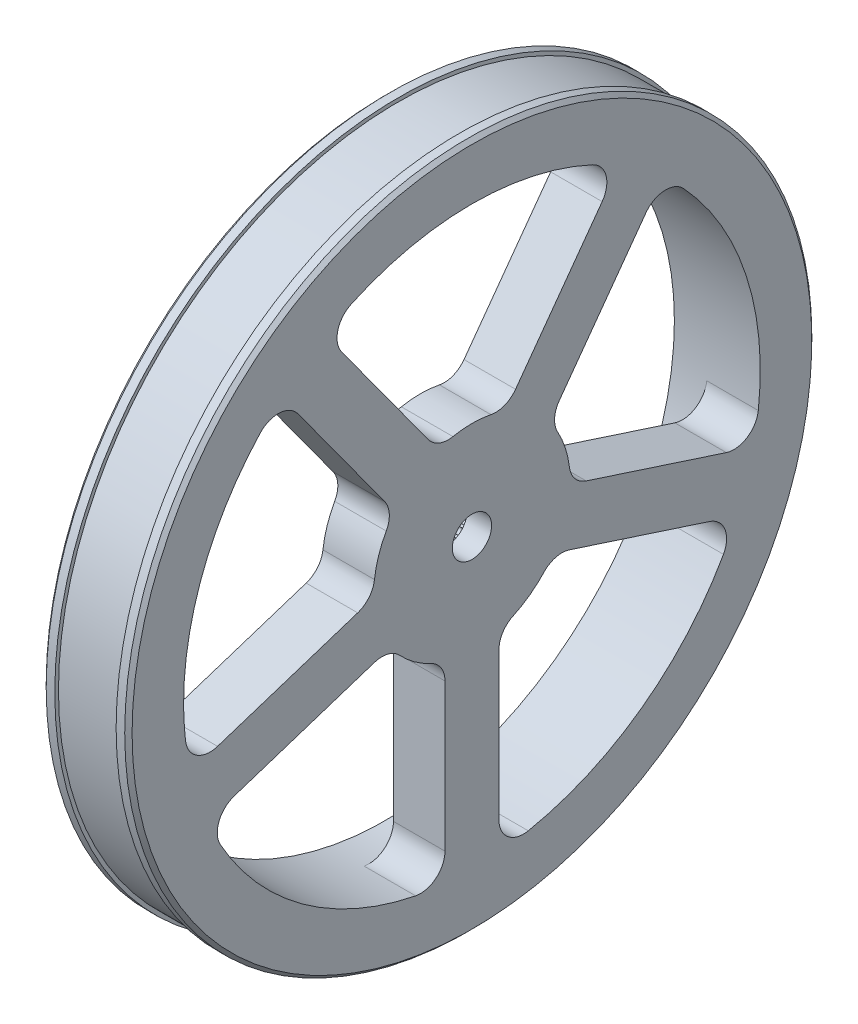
from build123d import *
from build123d.topology import SkipClean

# Parameters (mm, degrees)
ENL_V_START                  = -10
ENL_V_MAT_EXTRU_1_DEPTH      = 10
R_P_TITION_CIRCULAIRE2_COUNT = 5
ESQUISSE4_R                  = 0.25
ENL_V_MAT_EXTRU_3_DEPTH      = 2.2
R_P_TITION_CIRCULAIRE4_COUNT = 21


with BuildPart() as part:
    # Esquisse1 → R_volution1 (revolve)
    with BuildSketch(Plane.XY, mode=Mode.PRIVATE) as r_volution1_sk:
        Polygon((-5.325766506, 2.3), (-3.125766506, 2.3), (-3.125766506, 1.6), (-1.125766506, 1.6), (-1.125766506, 27.7), (-1.425766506, 28), (-2.125766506, 28), (-2.125766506, 27.7), (-7.125766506, 27.7), (-7.125766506, 28), (-7.825766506, 28), (-8.125766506, 27.7), (-8.125766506, 23.5), (-5.325766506, 23.5), align=None)
    revolve(r_volution1_sk.sketch.rotate(Axis((0, 0, 0), (1, 0, 0)), 90), axis=Axis((0, 0, 0), (1, 0, 0)))

    # Esquisse2 → Enl_v. mat.-Extru.1 (cut)
    with BuildSketch(Plane.ZY.offset(5.325766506).offset(ENL_V_START)):
        with BuildLine():
            Line((3.554455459, 8.635151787), (10.614071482, 18.351879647))
            ThreePointArc((10.614071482, 18.351879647), (10.931169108, 20.032688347), (9.83287819, 21.343957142))
            ThreePointArc((9.83287819, 21.343957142), (0, 23.5), (-9.83287819, 21.343957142))
            ThreePointArc((-9.83287819, 21.343957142), (-10.931169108, 20.032688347), (-10.614071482, 18.351879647))
            Line((-10.614071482, 18.351879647), (-3.554455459, 8.635151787))
            ThreePointArc((-3.554455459, 8.635151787), (-2.666737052, 7.948831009), (-1.549137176, 7.848577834))
            ThreePointArc((-1.549137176, 7.848577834), (0, 8), (1.549137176, 7.848577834))
            ThreePointArc((1.549137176, 7.848577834), (2.666737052, 7.948831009), (3.554455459, 8.635151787))
        make_face()
    enl_v_mat_extru_1 = extrude(amount=ENL_V_MAT_EXTRU_1_DEPTH, mode=Mode.SUBTRACT)

    # R_p_tition circulaire2: Enl_v. mat.-Extru.1 ×5 about axis
    with SkipClean():  # the faces are left unmerged after this step: merging them gives an invalid solid
        r_p_tition_circulaire2_axis = Axis((0, 0, 0), (1, 0, 0))
        for i in range(1, R_P_TITION_CIRCULAIRE2_COUNT):
            add(enl_v_mat_extru_1.rotate(r_p_tition_circulaire2_axis, i * 360 / R_P_TITION_CIRCULAIRE2_COUNT), mode=Mode.SUBTRACT)

    # Esquisse4 → Enl_v. mat.-Extru.3 (cut)
    with SkipClean():  # the faces are left unmerged after this step: merging them gives an invalid solid
        with BuildSketch(Plane.ZY.offset(5.325766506)):
            with Locations((0, 2.3)):
                Circle(ESQUISSE4_R)
        enl_v_mat_extru_3 = extrude(amount=-ENL_V_MAT_EXTRU_3_DEPTH, mode=Mode.SUBTRACT)

    # R_p_tition circulaire4: Enl_v. mat.-Extru.3 ×21 about axis
    with SkipClean():  # the faces are left unmerged after this step: merging them gives an invalid solid
        r_p_tition_circulaire4_axis = Axis((0, 0, 0), (1, 0, 0))
        for i in range(1, R_P_TITION_CIRCULAIRE4_COUNT):
            add(enl_v_mat_extru_3.rotate(r_p_tition_circulaire4_axis, i * 360 / R_P_TITION_CIRCULAIRE4_COUNT), mode=Mode.SUBTRACT)


solid = part.part
